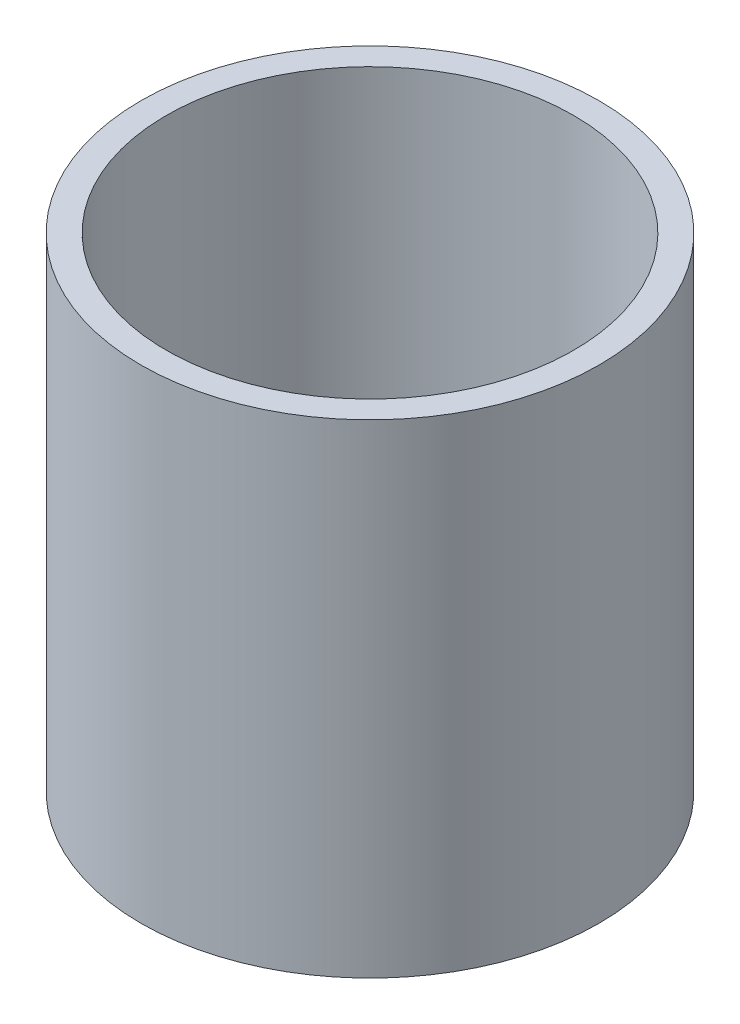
ISO-10303-21;
HEADER;
FILE_DESCRIPTION(('STEP AP214'),'2;1');
FILE_NAME('part.step','',(''),(''),'','','');
FILE_SCHEMA(('AUTOMOTIVE_DESIGN { 1 0 10303 214 1 1 1 1 }'));
ENDSEC;
DATA;
#1=APPLICATION_CONTEXT('core data for automotive mechanical design processes');
#2=APPLICATION_PROTOCOL_DEFINITION('international standard','automotive_design',2000,#1);
#3=PRODUCT_CONTEXT('',#1,'mechanical');
#4=PRODUCT('Part','Part','',(#3));
#5=PRODUCT_RELATED_PRODUCT_CATEGORY('part','',(#4));
#6=PRODUCT_DEFINITION_FORMATION('','',#4);
#7=PRODUCT_DEFINITION_CONTEXT('part definition',#1,'design');
#8=PRODUCT_DEFINITION('design','',#6,#7);
#9=PRODUCT_DEFINITION_SHAPE('','',#8);
#10=(LENGTH_UNIT() NAMED_UNIT(*) SI_UNIT(.MILLI.,.METRE.));
#11=(NAMED_UNIT(*) PLANE_ANGLE_UNIT() SI_UNIT($,.RADIAN.));
#12=(NAMED_UNIT(*) SI_UNIT($,.STERADIAN.) SOLID_ANGLE_UNIT());
#13=UNCERTAINTY_MEASURE_WITH_UNIT(LENGTH_MEASURE(1.E-05),#10,'distance_accuracy_value','');
#14=(GEOMETRIC_REPRESENTATION_CONTEXT(3) GLOBAL_UNCERTAINTY_ASSIGNED_CONTEXT((#13)) GLOBAL_UNIT_ASSIGNED_CONTEXT((#10,
#11,#12)) REPRESENTATION_CONTEXT('',''));
#15=CARTESIAN_POINT('',(0.,0.,0.));
#16=DIRECTION('',(0.,0.,1.));
#17=DIRECTION('',(1.,0.,0.));
#18=AXIS2_PLACEMENT_3D('',#15,#16,#17);
#19=CARTESIAN_POINT('',(14.2875,0.,0.));
#20=DIRECTION('',(0.,-1.,0.));
#21=DIRECTION('',(0.,0.,-1.));
#22=AXIS2_PLACEMENT_3D('',#19,#20,#21);
#23=PLANE('',#22);
#24=CARTESIAN_POINT('',(0.,0.,0.));
#25=DIRECTION('',(0.,-1.,0.));
#26=DIRECTION('',(0.,0.,-1.));
#27=AXIS2_PLACEMENT_3D('',#24,#25,#26);
#28=CIRCLE('',#27,14.2875);
#29=CARTESIAN_POINT('',(0.,0.,-14.2875));
#30=VERTEX_POINT('',#29);
#31=EDGE_CURVE('E42',#30,#30,#28,.T.);
#32=ORIENTED_EDGE('',*,*,#31,.T.);
#33=EDGE_LOOP('',(#32));
#34=FACE_BOUND('',#33,.T.);
#35=CARTESIAN_POINT('',(0.,0.,0.));
#36=DIRECTION('',(0.,-1.,0.));
#37=DIRECTION('',(0.,0.,-1.));
#38=AXIS2_PLACEMENT_3D('',#35,#36,#37);
#39=CIRCLE('',#38,12.7);
#40=CARTESIAN_POINT('',(0.,0.,-12.7));
#41=VERTEX_POINT('',#40);
#42=EDGE_CURVE('E10',#41,#41,#39,.T.);
#43=ORIENTED_EDGE('',*,*,#42,.F.);
#44=EDGE_LOOP('',(#43));
#45=FACE_BOUND('',#44,.T.);
#46=ADVANCED_FACE('F28',(#34,#45),#23,.T.);
#47=CARTESIAN_POINT('',(0.,0.,0.));
#48=DIRECTION('',(0.,-1.,0.));
#49=DIRECTION('',(0.,0.,-1.));
#50=AXIS2_PLACEMENT_3D('',#47,#48,#49);
#51=CYLINDRICAL_SURFACE('',#50,12.7);
#52=ORIENTED_EDGE('',*,*,#42,.T.);
#53=EDGE_LOOP('',(#52));
#54=FACE_BOUND('',#53,.T.);
#55=CARTESIAN_POINT('',(0.,30.1625,0.));
#56=DIRECTION('',(0.,-1.,0.));
#57=DIRECTION('',(0.,0.,-1.));
#58=AXIS2_PLACEMENT_3D('',#55,#56,#57);
#59=CIRCLE('',#58,12.7);
#60=CARTESIAN_POINT('',(0.,30.1625,-12.7));
#61=VERTEX_POINT('',#60);
#62=EDGE_CURVE('E34',#61,#61,#59,.T.);
#63=ORIENTED_EDGE('',*,*,#62,.F.);
#64=EDGE_LOOP('',(#63));
#65=FACE_BOUND('',#64,.T.);
#66=ADVANCED_FACE('F58',(#54,#65),#51,.F.);
#67=CARTESIAN_POINT('',(12.7,30.1625,0.));
#68=DIRECTION('',(0.,1.,0.));
#69=DIRECTION('',(0.,0.,1.));
#70=AXIS2_PLACEMENT_3D('',#67,#68,#69);
#71=PLANE('',#70);
#72=ORIENTED_EDGE('',*,*,#62,.T.);
#73=EDGE_LOOP('',(#72));
#74=FACE_BOUND('',#73,.T.);
#75=CARTESIAN_POINT('',(0.,30.1625,0.));
#76=DIRECTION('',(0.,-1.,0.));
#77=DIRECTION('',(0.,0.,-1.));
#78=AXIS2_PLACEMENT_3D('',#75,#76,#77);
#79=CIRCLE('',#78,14.2875);
#80=CARTESIAN_POINT('',(0.,30.1625,-14.2875));
#81=VERTEX_POINT('',#80);
#82=EDGE_CURVE('E38',#81,#81,#79,.T.);
#83=ORIENTED_EDGE('',*,*,#82,.F.);
#84=EDGE_LOOP('',(#83));
#85=FACE_BOUND('',#84,.T.);
#86=ADVANCED_FACE('F52',(#74,#85),#71,.T.);
#87=CARTESIAN_POINT('',(0.,0.,0.));
#88=DIRECTION('',(0.,-1.,0.));
#89=DIRECTION('',(0.,0.,-1.));
#90=AXIS2_PLACEMENT_3D('',#87,#88,#89);
#91=CYLINDRICAL_SURFACE('',#90,14.2875);
#92=ORIENTED_EDGE('',*,*,#82,.T.);
#93=EDGE_LOOP('',(#92));
#94=FACE_BOUND('',#93,.T.);
#95=ORIENTED_EDGE('',*,*,#31,.F.);
#96=EDGE_LOOP('',(#95));
#97=FACE_BOUND('',#96,.T.);
#98=ADVANCED_FACE('F50',(#94,#97),#91,.T.);
#99=CLOSED_SHELL('',(#46,#66,#86,#98));
#100=MANIFOLD_SOLID_BREP('B2',#99);
#101=ADVANCED_BREP_SHAPE_REPRESENTATION('',(#18,#100),#14);
#102=SHAPE_DEFINITION_REPRESENTATION(#9,#101);
ENDSEC;
END-ISO-10303-21;
